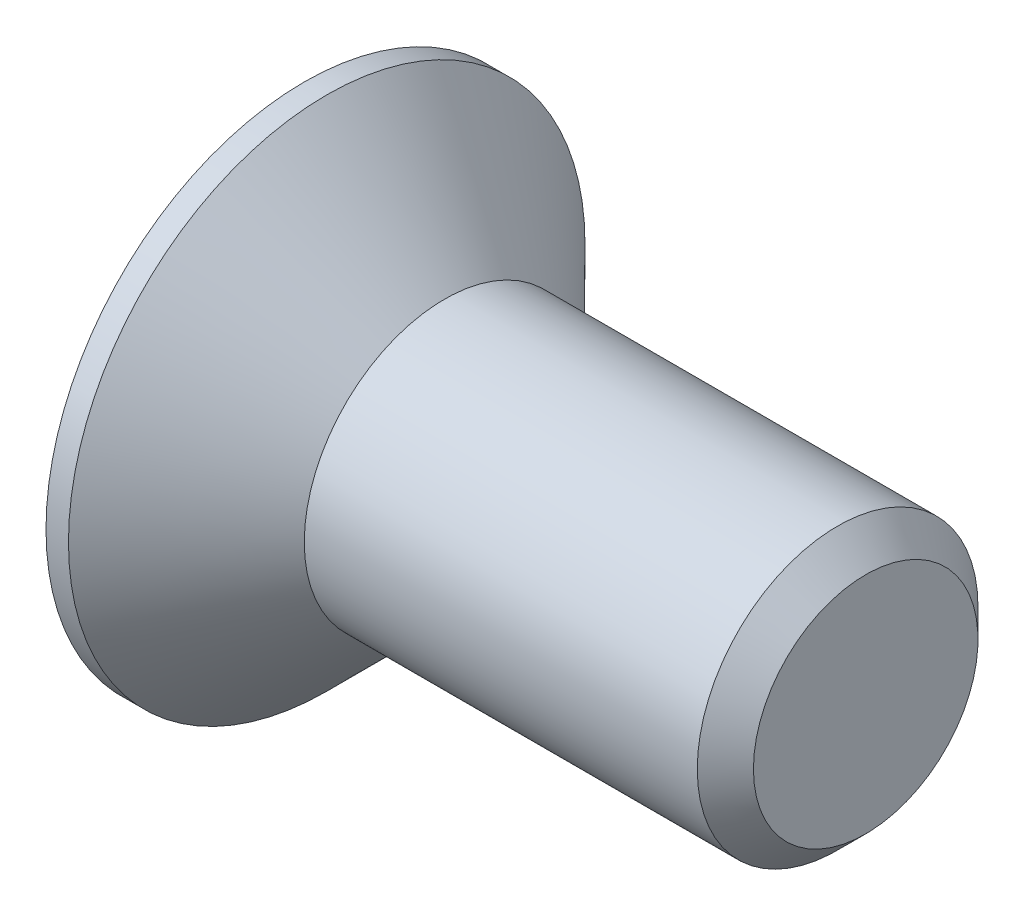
from build123d import *

# Parameters (mm, degrees)
CHAMFER1_SIZE      = 0.5
CUT_EXTRUDE1_DEPTH = 2.1


with BuildPart() as part:
    # Sketch1 → Revolve1 (revolve)
    with BuildSketch(Plane.XY, mode=Mode.PRIVATE) as revolve1_sk:
        Polygon((-2.5, 4.6), (-2.5, 0), (7.5, 0), (7.5, 2.5), (0, 2.5), (-2.1, 4.6), align=None)
    revolve(revolve1_sk.sketch.rotate(Axis((-2.5, 0, 0), (1, 0, 0)), 90), axis=Axis((-2.5, 0, 0), (1, 0, 0)))

    # Chamfer1
    chamfer1_edges = [part.edges().sort_by_distance(p)[0] for p in [
        (7.5, 0, -2.5),
    ]]
    chamfer(chamfer1_edges, length=CHAMFER1_SIZE)

    # Sketch2 → Cut-Extrude1 (cut)
    with BuildSketch(Plane.ZY.offset(2.5)):
        Polygon((-0.575, 2.3), (0.575, 2.3), (0.575, 0.575), (2.3, 0.575), (2.3, -0.575), (0.575, -0.575), (0.575, -2.3), (-0.575, -2.3), (-0.575, -0.575), (-2.3, -0.575), (-2.3, 0.575), (-0.575, 0.575), align=None)
    extrude(amount=-CUT_EXTRUDE1_DEPTH, mode=Mode.SUBTRACT)


solid = part.part
